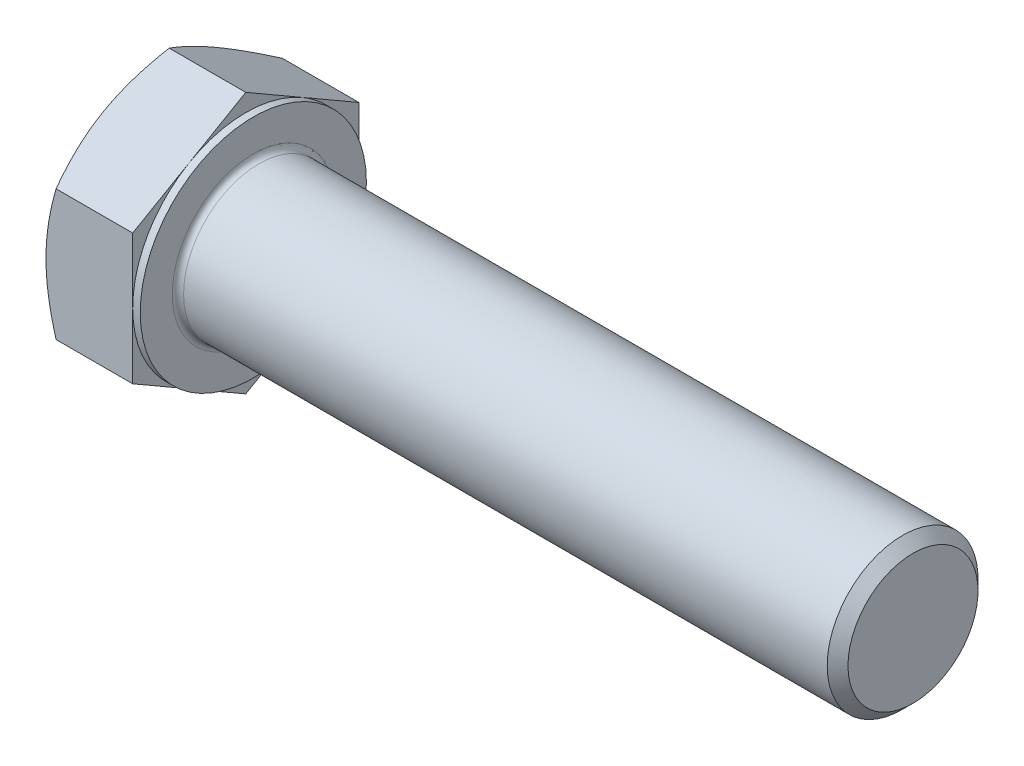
ISO-10303-21;
HEADER;
FILE_DESCRIPTION(('STEP AP214'),'2;1');
FILE_NAME('part.step','',(''),(''),'','','');
FILE_SCHEMA(('AUTOMOTIVE_DESIGN { 1 0 10303 214 1 1 1 1 }'));
ENDSEC;
DATA;
#1=APPLICATION_CONTEXT('core data for automotive mechanical design processes');
#2=APPLICATION_PROTOCOL_DEFINITION('international standard','automotive_design',2000,#1);
#3=PRODUCT_CONTEXT('',#1,'mechanical');
#4=PRODUCT('Part','Part','',(#3));
#5=PRODUCT_RELATED_PRODUCT_CATEGORY('part','',(#4));
#6=PRODUCT_DEFINITION_FORMATION('','',#4);
#7=PRODUCT_DEFINITION_CONTEXT('part definition',#1,'design');
#8=PRODUCT_DEFINITION('design','',#6,#7);
#9=PRODUCT_DEFINITION_SHAPE('','',#8);
#10=(LENGTH_UNIT() NAMED_UNIT(*) SI_UNIT(.MILLI.,.METRE.));
#11=(NAMED_UNIT(*) PLANE_ANGLE_UNIT() SI_UNIT($,.RADIAN.));
#12=(NAMED_UNIT(*) SI_UNIT($,.STERADIAN.) SOLID_ANGLE_UNIT());
#13=UNCERTAINTY_MEASURE_WITH_UNIT(LENGTH_MEASURE(1.E-05),#10,'distance_accuracy_value','');
#14=(GEOMETRIC_REPRESENTATION_CONTEXT(3) GLOBAL_UNCERTAINTY_ASSIGNED_CONTEXT((#13)) GLOBAL_UNIT_ASSIGNED_CONTEXT((#10,
#11,#12)) REPRESENTATION_CONTEXT('',''));
#15=CARTESIAN_POINT('',(0.,0.,0.));
#16=DIRECTION('',(0.,0.,1.));
#17=DIRECTION('',(1.,0.,0.));
#18=AXIS2_PLACEMENT_3D('',#15,#16,#17);
#19=CARTESIAN_POINT('',(10.,13.856406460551,0.));
#20=DIRECTION('',(1.,0.,0.));
#21=DIRECTION('',(0.,0.,-1.));
#22=AXIS2_PLACEMENT_3D('',#19,#20,#21);
#23=PLANE('',#22);
#24=CARTESIAN_POINT('',(10.,0.,0.));
#25=DIRECTION('',(1.,0.,0.));
#26=DIRECTION('',(0.,0.,-1.));
#27=AXIS2_PLACEMENT_3D('',#24,#25,#26);
#28=CIRCLE('',#27,8.6);
#29=CARTESIAN_POINT('',(10.,0.,-8.6));
#30=VERTEX_POINT('',#29);
#31=EDGE_CURVE('E43',#30,#30,#28,.F.);
#32=ORIENTED_EDGE('',*,*,#31,.T.);
#33=EDGE_LOOP('',(#32));
#34=FACE_BOUND('',#33,.T.);
#35=CARTESIAN_POINT('',(10.,0.,0.));
#36=DIRECTION('',(1.,0.,0.));
#37=DIRECTION('',(0.,0.,-1.));
#38=AXIS2_PLACEMENT_3D('',#35,#36,#37);
#39=CIRCLE('',#38,12.);
#40=CARTESIAN_POINT('',(10.,0.,-12.));
#41=VERTEX_POINT('',#40);
#42=EDGE_CURVE('E300',#41,#41,#39,.T.);
#43=ORIENTED_EDGE('',*,*,#42,.T.);
#44=EDGE_LOOP('',(#43));
#45=FACE_BOUND('',#44,.T.);
#46=ADVANCED_FACE('F35',(#34,#45),#23,.T.);
#47=CARTESIAN_POINT('',(0.,0.,0.));
#48=DIRECTION('',(-1.,0.,0.));
#49=DIRECTION('',(0.,0.,1.));
#50=AXIS2_PLACEMENT_3D('',#47,#48,#49);
#51=CYLINDRICAL_SURFACE('',#50,8.);
#52=CARTESIAN_POINT('',(10.6,0.,0.));
#53=DIRECTION('',(1.,0.,0.));
#54=DIRECTION('',(0.,0.,-1.));
#55=AXIS2_PLACEMENT_3D('',#52,#53,#54);
#56=CIRCLE('',#55,8.);
#57=CARTESIAN_POINT('',(10.6,0.,-8.));
#58=VERTEX_POINT('',#57);
#59=EDGE_CURVE('E11',#58,#58,#56,.T.);
#60=ORIENTED_EDGE('',*,*,#59,.T.);
#61=EDGE_LOOP('',(#60));
#62=FACE_BOUND('',#61,.T.);
#63=CARTESIAN_POINT('',(78.8985,0.,0.));
#64=DIRECTION('',(-1.,0.,0.));
#65=DIRECTION('',(0.,0.,1.));
#66=AXIS2_PLACEMENT_3D('',#63,#64,#65);
#67=CIRCLE('',#66,8.);
#68=CARTESIAN_POINT('',(78.8985,0.,8.));
#69=VERTEX_POINT('',#68);
#70=EDGE_CURVE('E279',#69,#69,#67,.T.);
#71=ORIENTED_EDGE('',*,*,#70,.T.);
#72=EDGE_LOOP('',(#71));
#73=FACE_BOUND('',#72,.T.);
#74=ADVANCED_FACE('F253',(#62,#73),#51,.T.);
#75=CARTESIAN_POINT('',(80.,0.,0.));
#76=DIRECTION('',(-1.,0.,0.));
#77=DIRECTION('',(0.,0.,1.));
#78=AXIS2_PLACEMENT_3D('',#75,#76,#77);
#79=CONICAL_SURFACE('',#78,6.8985,0.785398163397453);
#80=ORIENTED_EDGE('',*,*,#70,.F.);
#81=EDGE_LOOP('',(#80));
#82=FACE_BOUND('',#81,.T.);
#83=CARTESIAN_POINT('',(80.,0.,0.));
#84=DIRECTION('',(-1.,0.,0.));
#85=DIRECTION('',(0.,0.,1.));
#86=AXIS2_PLACEMENT_3D('',#83,#84,#85);
#87=CIRCLE('',#86,6.8985);
#88=CARTESIAN_POINT('',(80.,0.,6.8985));
#89=VERTEX_POINT('',#88);
#90=EDGE_CURVE('E277',#89,#89,#87,.T.);
#91=ORIENTED_EDGE('',*,*,#90,.T.);
#92=EDGE_LOOP('',(#91));
#93=FACE_BOUND('',#92,.T.);
#94=ADVANCED_FACE('F258',(#82,#93),#79,.T.);
#95=CARTESIAN_POINT('',(80.,0.,0.));
#96=DIRECTION('',(-1.,0.,0.));
#97=DIRECTION('',(0.,0.,1.));
#98=AXIS2_PLACEMENT_3D('',#95,#96,#97);
#99=PLANE('',#98);
#100=ORIENTED_EDGE('',*,*,#90,.F.);
#101=EDGE_LOOP('',(#100));
#102=FACE_BOUND('',#101,.T.);
#103=ADVANCED_FACE('F265',(#102),#99,.F.);
#104=CARTESIAN_POINT('',(9.2,12.,0.));
#105=DIRECTION('',(1.,0.,0.));
#106=DIRECTION('',(0.,0.,-1.));
#107=AXIS2_PLACEMENT_3D('',#104,#105,#106);
#108=PLANE('',#107);
#109=DIRECTION('',(0.,0.500000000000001,0.866025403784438));
#110=VECTOR('',#109,1.);
#111=CARTESIAN_POINT('',(9.2,6.9282032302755,-12.));
#112=LINE('',#111,#110);
#113=CARTESIAN_POINT('',(9.2,6.9282032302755,-12.));
#114=VERTEX_POINT('',#113);
#115=CARTESIAN_POINT('',(9.2,10.3923048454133,-6.00000000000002));
#116=VERTEX_POINT('',#115);
#117=EDGE_CURVE('E167',#114,#116,#112,.T.);
#118=ORIENTED_EDGE('',*,*,#117,.T.);
#119=CARTESIAN_POINT('',(9.2,0.,0.));
#120=DIRECTION('',(-1.,0.,0.));
#121=DIRECTION('',(0.,0.,1.));
#122=AXIS2_PLACEMENT_3D('',#119,#120,#121);
#123=CIRCLE('',#122,12.);
#124=CARTESIAN_POINT('',(9.2,0.,-12.));
#125=VERTEX_POINT('',#124);
#126=EDGE_CURVE('E50',#116,#125,#123,.T.);
#127=ORIENTED_EDGE('',*,*,#126,.T.);
#128=DIRECTION('',(0.,1.,0.));
#129=VECTOR('',#128,1.);
#130=CARTESIAN_POINT('',(9.2,6.9282032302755,-12.));
#131=LINE('',#130,#129);
#132=EDGE_CURVE('E303',#125,#114,#131,.T.);
#133=ORIENTED_EDGE('',*,*,#132,.T.);
#134=EDGE_LOOP('',(#118,#127,#133));
#135=FACE_BOUND('',#134,.T.);
#136=ADVANCED_FACE('F268',(#135),#108,.T.);
#137=CARTESIAN_POINT('',(9.2,13.856406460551,0.));
#138=VERTEX_POINT('',#137);
#139=EDGE_CURVE('E165',#116,#138,#112,.T.);
#140=ORIENTED_EDGE('',*,*,#139,.T.);
#141=DIRECTION('',(0.,-0.500000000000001,0.866025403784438));
#142=VECTOR('',#141,1.);
#143=CARTESIAN_POINT('',(9.2,13.856406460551,0.));
#144=LINE('',#143,#142);
#145=CARTESIAN_POINT('',(9.2,10.3923048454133,6.00000000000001));
#146=VERTEX_POINT('',#145);
#147=EDGE_CURVE('E164',#138,#146,#144,.T.);
#148=ORIENTED_EDGE('',*,*,#147,.T.);
#149=EDGE_CURVE('E153',#146,#116,#123,.T.);
#150=ORIENTED_EDGE('',*,*,#149,.T.);
#151=EDGE_LOOP('',(#140,#148,#150));
#152=FACE_BOUND('',#151,.T.);
#153=ADVANCED_FACE('F273',(#152),#108,.T.);
#154=CARTESIAN_POINT('',(9.2,6.9282032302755,12.));
#155=VERTEX_POINT('',#154);
#156=EDGE_CURVE('E132',#146,#155,#144,.T.);
#157=ORIENTED_EDGE('',*,*,#156,.T.);
#158=DIRECTION('',(0.,-1.,0.));
#159=VECTOR('',#158,1.);
#160=CARTESIAN_POINT('',(9.2,6.9282032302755,12.));
#161=LINE('',#160,#159);
#162=CARTESIAN_POINT('',(9.2,0.,12.));
#163=VERTEX_POINT('',#162);
#164=EDGE_CURVE('E126',#155,#163,#161,.T.);
#165=ORIENTED_EDGE('',*,*,#164,.T.);
#166=EDGE_CURVE('E130',#163,#146,#123,.T.);
#167=ORIENTED_EDGE('',*,*,#166,.T.);
#168=EDGE_LOOP('',(#157,#165,#167));
#169=FACE_BOUND('',#168,.T.);
#170=ADVANCED_FACE('F128',(#169),#108,.T.);
#171=CARTESIAN_POINT('',(9.2,-6.92820323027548,12.));
#172=VERTEX_POINT('',#171);
#173=EDGE_CURVE('E136',#163,#172,#161,.T.);
#174=ORIENTED_EDGE('',*,*,#173,.T.);
#175=DIRECTION('',(0.,-0.500000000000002,-0.866025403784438));
#176=VECTOR('',#175,1.);
#177=CARTESIAN_POINT('',(9.2,-13.856406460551,0.));
#178=LINE('',#177,#176);
#179=CARTESIAN_POINT('',(9.2,-10.3923048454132,6.00000000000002));
#180=VERTEX_POINT('',#179);
#181=EDGE_CURVE('E143',#172,#180,#178,.T.);
#182=ORIENTED_EDGE('',*,*,#181,.T.);
#183=EDGE_CURVE('E140',#180,#163,#123,.T.);
#184=ORIENTED_EDGE('',*,*,#183,.T.);
#185=EDGE_LOOP('',(#174,#182,#184));
#186=FACE_BOUND('',#185,.T.);
#187=ADVANCED_FACE('F141',(#186),#108,.T.);
#188=CARTESIAN_POINT('',(9.2,-13.856406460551,0.));
#189=VERTEX_POINT('',#188);
#190=EDGE_CURVE('E159',#180,#189,#178,.T.);
#191=ORIENTED_EDGE('',*,*,#190,.T.);
#192=DIRECTION('',(0.,0.5,-0.866025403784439));
#193=VECTOR('',#192,1.);
#194=CARTESIAN_POINT('',(9.2,-6.92820323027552,-12.));
#195=LINE('',#194,#193);
#196=CARTESIAN_POINT('',(9.2,-10.3923048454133,-6.));
#197=VERTEX_POINT('',#196);
#198=EDGE_CURVE('E341',#189,#197,#195,.T.);
#199=ORIENTED_EDGE('',*,*,#198,.T.);
#200=EDGE_CURVE('E147',#197,#180,#123,.T.);
#201=ORIENTED_EDGE('',*,*,#200,.T.);
#202=EDGE_LOOP('',(#191,#199,#201));
#203=FACE_BOUND('',#202,.T.);
#204=ADVANCED_FACE('F342',(#203),#108,.T.);
#205=CARTESIAN_POINT('',(9.2,-6.92820323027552,-12.));
#206=VERTEX_POINT('',#205);
#207=EDGE_CURVE('E154',#197,#206,#195,.T.);
#208=ORIENTED_EDGE('',*,*,#207,.T.);
#209=EDGE_CURVE('E304',#206,#125,#131,.T.);
#210=ORIENTED_EDGE('',*,*,#209,.T.);
#211=EDGE_CURVE('E311',#125,#197,#123,.T.);
#212=ORIENTED_EDGE('',*,*,#211,.T.);
#213=EDGE_LOOP('',(#208,#210,#212));
#214=FACE_BOUND('',#213,.T.);
#215=ADVANCED_FACE('F274',(#214),#108,.T.);
#216=CARTESIAN_POINT('',(0.,0.,0.));
#217=DIRECTION('',(-1.,0.,0.));
#218=DIRECTION('',(0.,0.,1.));
#219=AXIS2_PLACEMENT_3D('',#216,#217,#218);
#220=CYLINDRICAL_SURFACE('',#219,12.);
#221=ORIENTED_EDGE('',*,*,#126,.F.);
#222=ORIENTED_EDGE('',*,*,#149,.F.);
#223=ORIENTED_EDGE('',*,*,#166,.F.);
#224=ORIENTED_EDGE('',*,*,#183,.F.);
#225=ORIENTED_EDGE('',*,*,#200,.F.);
#226=ORIENTED_EDGE('',*,*,#211,.F.);
#227=EDGE_LOOP('',(#221,#222,#223,#224,#225,#226));
#228=FACE_BOUND('',#227,.T.);
#229=ORIENTED_EDGE('',*,*,#42,.F.);
#230=EDGE_LOOP('',(#229));
#231=FACE_BOUND('',#230,.T.);
#232=ADVANCED_FACE('F150',(#228,#231),#220,.T.);
#233=CARTESIAN_POINT('',(0.,13.856406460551,0.));
#234=DIRECTION('',(1.,0.,0.));
#235=DIRECTION('',(0.,0.,-1.));
#236=AXIS2_PLACEMENT_3D('',#233,#234,#235);
#237=PLANE('',#236);
#238=CARTESIAN_POINT('',(0.,0.,0.));
#239=DIRECTION('',(1.,0.,0.));
#240=DIRECTION('',(0.,0.,-1.));
#241=AXIS2_PLACEMENT_3D('',#238,#239,#240);
#242=CIRCLE('',#241,12.);
#243=CARTESIAN_POINT('',(0.,0.,-12.));
#244=VERTEX_POINT('',#243);
#245=CARTESIAN_POINT('',(0.,10.3923048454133,-6.00000000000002));
#246=VERTEX_POINT('',#245);
#247=EDGE_CURVE('E299',#244,#246,#242,.T.);
#248=ORIENTED_EDGE('',*,*,#247,.F.);
#249=CARTESIAN_POINT('',(0.,-10.3923048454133,-6.));
#250=VERTEX_POINT('',#249);
#251=EDGE_CURVE('E295',#250,#244,#242,.T.);
#252=ORIENTED_EDGE('',*,*,#251,.F.);
#253=CARTESIAN_POINT('',(0.,-10.3923048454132,6.00000000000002));
#254=VERTEX_POINT('',#253);
#255=EDGE_CURVE('E298',#254,#250,#242,.T.);
#256=ORIENTED_EDGE('',*,*,#255,.F.);
#257=CARTESIAN_POINT('',(0.,0.,12.));
#258=VERTEX_POINT('',#257);
#259=EDGE_CURVE('E334',#258,#254,#242,.T.);
#260=ORIENTED_EDGE('',*,*,#259,.F.);
#261=CARTESIAN_POINT('',(0.,0.,0.));
#262=DIRECTION('',(-1.,0.,0.));
#263=DIRECTION('',(0.,0.,1.));
#264=AXIS2_PLACEMENT_3D('',#261,#262,#263);
#265=CIRCLE('',#264,12.);
#266=CARTESIAN_POINT('',(0.,10.3923048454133,6.00000000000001));
#267=VERTEX_POINT('',#266);
#268=EDGE_CURVE('E168',#258,#267,#265,.T.);
#269=ORIENTED_EDGE('',*,*,#268,.T.);
#270=EDGE_CURVE('E357',#246,#267,#242,.T.);
#271=ORIENTED_EDGE('',*,*,#270,.F.);
#272=EDGE_LOOP('',(#248,#252,#256,#260,#269,#271));
#273=FACE_BOUND('',#272,.T.);
#274=ADVANCED_FACE('F199',(#273),#237,.F.);
#275=CARTESIAN_POINT('',(0.,0.,0.));
#276=DIRECTION('',(1.,0.,0.));
#277=DIRECTION('',(0.,0.,-1.));
#278=AXIS2_PLACEMENT_3D('',#275,#276,#277);
#279=CONICAL_SURFACE('',#278,12.,1.0471975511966);
#280=CARTESIAN_POINT('',(1.07186343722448,6.92808776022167,12.0002));
#281=CARTESIAN_POINT('',(0.983949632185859,7.08038456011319,11.7364142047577));
#282=CARTESIAN_POINT('',(0.900025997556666,7.2332492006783,11.4716448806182));
#283=CARTESIAN_POINT('',(0.74126621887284,7.54020434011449,10.9399829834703));
#284=CARTESIAN_POINT('',(0.666433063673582,7.69429522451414,10.6730897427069));
#285=CARTESIAN_POINT('',(0.457017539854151,8.15905073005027,9.86810959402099));
#286=CARTESIAN_POINT('',(0.337903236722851,8.47155003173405,9.3268449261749));
#287=CARTESIAN_POINT('',(0.198231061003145,8.93919090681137,8.516867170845));
#288=CARTESIAN_POINT('',(0.158443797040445,9.09293539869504,8.25057389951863));
#289=CARTESIAN_POINT('',(0.0917233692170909,9.40113622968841,7.71675440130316));
#290=CARTESIAN_POINT('',(0.064790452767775,9.55559258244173,7.44922815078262));
#291=CARTESIAN_POINT('',(0.0244685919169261,9.86476279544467,6.91372963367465));
#292=CARTESIAN_POINT('',(0.0110635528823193,10.0194761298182,6.64575827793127));
#293=CARTESIAN_POINT('',(-0.00191690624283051,10.3290461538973,6.10956726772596));
#294=CARTESIAN_POINT('',(-0.00149275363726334,10.4839028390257,5.84134762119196));
#295=CARTESIAN_POINT('',(0.0122200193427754,10.7734076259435,5.3399106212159));
#296=CARTESIAN_POINT('',(0.0238359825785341,10.908076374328,5.10665750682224));
#297=CARTESIAN_POINT('',(0.0573080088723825,11.1771041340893,4.64068775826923));
#298=CARTESIAN_POINT('',(0.0791647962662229,11.3114631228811,4.40797116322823));
#299=CARTESIAN_POINT('',(0.132737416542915,11.5797983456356,3.94320092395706));
#300=CARTESIAN_POINT('',(0.164461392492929,11.7137741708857,3.711147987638));
#301=CARTESIAN_POINT('',(0.237211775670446,11.9810977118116,3.24813003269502));
#302=CARTESIAN_POINT('',(0.278238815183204,12.1144453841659,3.01716508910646));
#303=CARTESIAN_POINT('',(0.416311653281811,12.5192297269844,2.31605804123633));
#304=CARTESIAN_POINT('',(0.527124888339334,12.789494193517,1.84794625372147));
#305=CARTESIAN_POINT('',(0.778625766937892,13.3259930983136,0.918702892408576));
#306=CARTESIAN_POINT('',(0.919254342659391,13.5922344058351,0.457559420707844));
#307=CARTESIAN_POINT('',(1.07186343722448,13.8565219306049,-0.000200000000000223));
#308=B_SPLINE_CURVE_WITH_KNOTS('',3,(#280,#281,#282,#283,#284,#285,#286,#287,#288,#289,#290,
#291,#292,#293,#294,#295,#296,#297,#298,#299,#300,#301,#302,#303,#304,#305,#306,#307),
.UNSPECIFIED.,.F.,.F.,(4,2,2,2,2,2,2,2,2,2,2,2,2,4),(0.,0.951004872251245,1.90232158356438,
3.80900466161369,4.7389455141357,5.66890426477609,6.59775529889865,7.5265776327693,
8.33514643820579,9.14377244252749,9.95306755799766,10.7624176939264,12.4167102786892,
14.0677556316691),.UNSPECIFIED.);
#309=CARTESIAN_POINT('',(1.07179676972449,13.856406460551,0.));
#310=VERTEX_POINT('',#309);
#311=EDGE_CURVE('E219',#267,#310,#308,.T.);
#312=ORIENTED_EDGE('',*,*,#311,.T.);
#313=CARTESIAN_POINT('',(1.07186343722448,13.8565219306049,0.000199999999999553));
#314=CARTESIAN_POINT('',(0.983949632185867,13.7042251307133,-0.263585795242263));
#315=CARTESIAN_POINT('',(0.900025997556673,13.5513604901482,-0.5283551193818));
#316=CARTESIAN_POINT('',(0.741266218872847,13.244405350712,-1.06001701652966));
#317=CARTESIAN_POINT('',(0.666433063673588,13.0903144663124,-1.32691025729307));
#318=CARTESIAN_POINT('',(0.457017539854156,12.6255589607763,-2.13189040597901));
#319=CARTESIAN_POINT('',(0.337903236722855,12.3130596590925,-2.6731550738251));
#320=CARTESIAN_POINT('',(0.198231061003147,11.8454187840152,-3.483132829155));
#321=CARTESIAN_POINT('',(0.158443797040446,11.6916742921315,-3.74942610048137));
#322=CARTESIAN_POINT('',(0.0917233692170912,11.3834734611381,-4.28324559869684));
#323=CARTESIAN_POINT('',(0.0647904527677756,11.2290171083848,-4.55077184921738));
#324=CARTESIAN_POINT('',(0.0244685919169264,10.9198468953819,-5.08627036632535));
#325=CARTESIAN_POINT('',(0.011063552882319,10.7651335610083,-5.35424172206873));
#326=CARTESIAN_POINT('',(-0.00191690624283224,10.4555635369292,-5.89043273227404));
#327=CARTESIAN_POINT('',(-0.00149275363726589,10.3007068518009,-6.15865237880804));
#328=CARTESIAN_POINT('',(0.0122200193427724,10.011202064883,-6.66008937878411));
#329=CARTESIAN_POINT('',(0.0238359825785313,9.87653331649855,-6.89334249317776));
#330=CARTESIAN_POINT('',(0.0573080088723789,9.60750555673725,-7.35931224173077));
#331=CARTESIAN_POINT('',(0.0791647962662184,9.47314656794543,-7.59202883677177));
#332=CARTESIAN_POINT('',(0.13273741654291,9.20481134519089,-8.05679907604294));
#333=CARTESIAN_POINT('',(0.164461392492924,9.07083551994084,-8.288852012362));
#334=CARTESIAN_POINT('',(0.237211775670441,8.80351197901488,-8.75186996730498));
#335=CARTESIAN_POINT('',(0.278238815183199,8.67016430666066,-8.98283491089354));
#336=CARTESIAN_POINT('',(0.416311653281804,8.2653799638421,-9.68394195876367));
#337=CARTESIAN_POINT('',(0.527124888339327,7.99511549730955,-10.1520537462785));
#338=CARTESIAN_POINT('',(0.778625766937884,7.45861659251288,-11.0812971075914));
#339=CARTESIAN_POINT('',(0.919254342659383,7.19237528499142,-11.5424405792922));
#340=CARTESIAN_POINT('',(1.07186343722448,6.92808776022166,-12.0002));
#341=B_SPLINE_CURVE_WITH_KNOTS('',3,(#313,#314,#315,#316,#317,#318,#319,#320,#321,#322,#323,
#324,#325,#326,#327,#328,#329,#330,#331,#332,#333,#334,#335,#336,#337,#338,#339,#340),
.UNSPECIFIED.,.F.,.F.,(4,2,2,2,2,2,2,2,2,2,2,2,2,4),(0.,0.951004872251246,1.90232158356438,
3.80900466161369,4.73894551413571,5.6689042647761,6.59775529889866,7.52657763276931,
8.33514643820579,9.1437724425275,9.95306755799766,10.7624176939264,12.4167102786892,
14.0677556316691),.UNSPECIFIED.);
#342=EDGE_CURVE('E58',#310,#246,#341,.T.);
#343=ORIENTED_EDGE('',*,*,#342,.T.);
#344=ORIENTED_EDGE('',*,*,#270,.T.);
#345=EDGE_LOOP('',(#312,#343,#344));
#346=FACE_BOUND('',#345,.T.);
#347=ADVANCED_FACE('F358',(#346),#279,.T.);
#348=CARTESIAN_POINT('',(5.93796522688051,-18.7780422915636,12.));
#349=CARTESIAN_POINT('',(5.8101358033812,-18.5152821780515,12.));
#350=CARTESIAN_POINT('',(5.68293120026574,-18.2522182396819,12.));
#351=CARTESIAN_POINT('',(5.42991281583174,-17.7254193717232,12.));
#352=CARTESIAN_POINT('',(5.3040990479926,-17.4616844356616,12.));
#353=CARTESIAN_POINT('',(4.92892368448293,-16.669310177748,12.));
#354=CARTESIAN_POINT('',(4.68186469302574,-16.1395765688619,12.));
#355=CARTESIAN_POINT('',(4.19405480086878,-15.0738169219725,12.));
#356=CARTESIAN_POINT('',(3.95334413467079,-14.5377724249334,12.));
#357=CARTESIAN_POINT('',(3.4815471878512,-13.4614790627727,12.));
#358=CARTESIAN_POINT('',(3.25046046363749,-12.9212303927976,12.));
#359=CARTESIAN_POINT('',(2.79294900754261,-11.8175688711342,12.));
#360=CARTESIAN_POINT('',(2.56693655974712,-11.2539842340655,12.));
#361=CARTESIAN_POINT('',(2.13161283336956,-10.1202797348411,12.));
#362=CARTESIAN_POINT('',(1.92230340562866,-9.55015915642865,12.));
#363=CARTESIAN_POINT('',(1.52576124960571,-8.40350794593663,12.));
#364=CARTESIAN_POINT('',(1.33848523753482,-7.82699240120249,12.));
#365=CARTESIAN_POINT('',(0.991896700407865,-6.66563869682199,12.));
#366=CARTESIAN_POINT('',(0.832575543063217,-6.08080316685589,12.));
#367=CARTESIAN_POINT('',(0.620681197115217,-5.19882791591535,12.));
#368=CARTESIAN_POINT('',(0.554713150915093,-4.90488790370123,12.));
#369=CARTESIAN_POINT('',(0.432574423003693,-4.31496880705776,12.));
#370=CARTESIAN_POINT('',(0.376403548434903,-4.01898976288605,12.));
#371=CARTESIAN_POINT('',(0.274840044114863,-3.4251844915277,12.));
#372=CARTESIAN_POINT('',(0.229447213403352,-3.12735829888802,12.));
#373=CARTESIAN_POINT('',(0.150338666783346,-2.53016033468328,12.));
#374=CARTESIAN_POINT('',(0.116622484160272,-2.23078862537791,12.));
#375=CARTESIAN_POINT('',(0.0619693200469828,-1.6348995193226,12.));
#376=CARTESIAN_POINT('',(0.0408679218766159,-1.33839729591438,12.));
#377=CARTESIAN_POINT('',(0.0112310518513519,-0.744766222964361,12.));
#378=CARTESIAN_POINT('',(0.00269536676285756,-0.447637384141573,12.));
#379=CARTESIAN_POINT('',(-0.00160621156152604,0.146715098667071,12.));
#380=CARTESIAN_POINT('',(0.00262788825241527,0.44393874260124,12.));
#381=CARTESIAN_POINT('',(0.0237602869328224,1.03793868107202,12.));
#382=CARTESIAN_POINT('',(0.0406591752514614,1.33471495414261,12.));
#383=CARTESIAN_POINT('',(0.0957363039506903,2.04293812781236,12.));
#384=CARTESIAN_POINT('',(0.139644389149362,2.45394931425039,12.));
#385=CARTESIAN_POINT('',(0.249393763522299,3.27301120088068,12.));
#386=CARTESIAN_POINT('',(0.315237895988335,3.68106151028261,12.));
#387=CARTESIAN_POINT('',(0.542190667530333,4.90025554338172,12.));
#388=CARTESIAN_POINT('',(0.732681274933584,5.70600726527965,12.));
#389=CARTESIAN_POINT('',(1.06415793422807,6.91101760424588,12.));
#390=CARTESIAN_POINT('',(1.18384338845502,7.31649624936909,12.));
#391=CARTESIAN_POINT('',(1.43593551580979,8.12351840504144,12.));
#392=CARTESIAN_POINT('',(1.56834227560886,8.52506188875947,12.));
#393=CARTESIAN_POINT('',(1.8437286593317,9.324334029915,12.));
#394=CARTESIAN_POINT('',(1.98670500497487,9.72206382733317,12.));
#395=CARTESIAN_POINT('',(2.28151949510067,10.5142091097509,12.));
#396=CARTESIAN_POINT('',(2.43335751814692,10.9086246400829,12.));
#397=CARTESIAN_POINT('',(2.81137815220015,11.863644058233,12.));
#398=CARTESIAN_POINT('',(3.04143185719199,12.4227131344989,12.));
#399=CARTESIAN_POINT('',(3.51333410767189,13.5358669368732,12.));
#400=CARTESIAN_POINT('',(3.75518348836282,14.0899513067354,12.));
#401=CARTESIAN_POINT('',(4.24823475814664,15.1941025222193,12.));
#402=CARTESIAN_POINT('',(4.49943904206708,15.7441682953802,12.));
#403=CARTESIAN_POINT('',(5.00924553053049,16.840834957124,12.));
#404=CARTESIAN_POINT('',(5.2678475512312,17.3874359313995,12.));
#405=CARTESIAN_POINT('',(5.79133880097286,18.4784293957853,12.));
#406=CARTESIAN_POINT('',(6.05623527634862,19.0228184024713,12.));
#407=CARTESIAN_POINT('',(6.59090796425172,20.1091945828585,12.));
#408=CARTESIAN_POINT('',(6.86068420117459,20.651181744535,12.));
#409=CARTESIAN_POINT('',(7.4042149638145,21.7330545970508,12.));
#410=CARTESIAN_POINT('',(7.67796889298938,22.2729405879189,12.));
#411=CARTESIAN_POINT('',(8.22882461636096,23.3510028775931,12.));
#412=CARTESIAN_POINT('',(8.5059264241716,23.8891791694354,12.));
#413=CARTESIAN_POINT('',(9.2922659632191,25.4066579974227,12.));
#414=CARTESIAN_POINT('',(9.80475659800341,26.3842748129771,12.));
#415=CARTESIAN_POINT('',(10.8366490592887,28.3358962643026,12.));
#416=CARTESIAN_POINT('',(11.3560511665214,29.3099007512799,12.));
#417=CARTESIAN_POINT('',(12.3986980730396,31.2524398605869,12.));
#418=CARTESIAN_POINT('',(12.921928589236,32.2209821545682,12.));
#419=CARTESIAN_POINT('',(13.7098172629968,33.6721037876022,12.));
#420=CARTESIAN_POINT('',(13.9729461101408,34.1555146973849,12.));
#421=CARTESIAN_POINT('',(14.5001155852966,35.1218381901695,12.));
#422=CARTESIAN_POINT('',(14.7641562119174,35.6047507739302,12.));
#423=CARTESIAN_POINT('',(15.0285993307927,36.0874429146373,12.));
#424=B_SPLINE_CURVE_WITH_KNOTS('',3,(#348,#349,#350,#351,#352,#353,#354,#355,#356,#357,#358,
#359,#360,#361,#362,#363,#364,#365,#366,#367,#368,#369,#370,#371,#372,#373,#374,#375,#376,#377,
#378,#379,#380,#381,#382,#383,#384,#385,#386,#387,#388,#389,#390,#391,#392,#393,#394,#395,#396,
#397,#398,#399,#400,#401,#402,#403,#404,#405,#406,#407,#408,#409,#410,#411,#412,#413,#414,#415,
#416,#417,#418,#419,#420,#421,#422,#423),.UNSPECIFIED.,.F.,.F.,(4,2,2,2,2,2,2,2,2,2,2,2,2,2,2,2,
2,2,2,2,2,2,2,2,2,2,2,2,2,2,2,2,2,2,2,2,2,4),(0.,0.876610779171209,1.75323004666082,
3.50671945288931,5.26947518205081,7.03214957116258,8.85359042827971,10.6752328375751,
12.4932347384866,14.3106742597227,15.2142921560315,16.1178922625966,17.02147551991,
17.9250226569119,18.8165208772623,19.7080039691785,20.5994865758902,21.4910106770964,
22.7303633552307,23.9698767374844,26.4502079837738,27.7184187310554,28.9866381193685,
30.2544657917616,31.5222760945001,33.3357454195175,35.1493433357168,36.963408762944,
38.7774291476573,40.5936500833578,42.4098801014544,44.2258404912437,46.0418082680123,
49.353175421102,52.6646774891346,55.9671781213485,57.6183303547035,59.2694800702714),.UNSPECIFIED.);
#425=CARTESIAN_POINT('',(1.07179676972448,6.92820323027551,12.));
#426=VERTEX_POINT('',#425);
#427=EDGE_CURVE('E233',#258,#426,#424,.T.);
#428=ORIENTED_EDGE('',*,*,#427,.T.);
#429=EDGE_CURVE('E232',#426,#267,#308,.T.);
#430=ORIENTED_EDGE('',*,*,#429,.T.);
#431=ORIENTED_EDGE('',*,*,#268,.F.);
#432=EDGE_LOOP('',(#428,#430,#431));
#433=FACE_BOUND('',#432,.T.);
#434=ADVANCED_FACE('F328',(#433),#279,.T.);
#435=CARTESIAN_POINT('',(1.07179676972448,-6.92820323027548,12.));
#436=VERTEX_POINT('',#435);
#437=EDGE_CURVE('E280',#436,#258,#424,.T.);
#438=ORIENTED_EDGE('',*,*,#437,.T.);
#439=ORIENTED_EDGE('',*,*,#259,.T.);
#440=CARTESIAN_POINT('',(1.07186343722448,-13.8565219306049,-0.000200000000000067));
#441=CARTESIAN_POINT('',(0.983949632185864,-13.7042251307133,0.263585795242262));
#442=CARTESIAN_POINT('',(0.900025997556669,-13.5513604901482,0.528355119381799));
#443=CARTESIAN_POINT('',(0.741266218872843,-13.244405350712,1.06001701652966));
#444=CARTESIAN_POINT('',(0.666433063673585,-13.0903144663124,1.32691025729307));
#445=CARTESIAN_POINT('',(0.457017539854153,-12.6255589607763,2.13189040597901));
#446=CARTESIAN_POINT('',(0.33790323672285,-12.3130596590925,2.6731550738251));
#447=CARTESIAN_POINT('',(0.198231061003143,-11.8454187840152,3.48313282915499));
#448=CARTESIAN_POINT('',(0.158443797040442,-11.6916742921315,3.74942610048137));
#449=CARTESIAN_POINT('',(0.0917233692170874,-11.3834734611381,4.28324559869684));
#450=CARTESIAN_POINT('',(0.0647904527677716,-11.2290171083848,4.55077184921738));
#451=CARTESIAN_POINT('',(0.0244685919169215,-10.9198468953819,5.08627036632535));
#452=CARTESIAN_POINT('',(0.0110635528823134,-10.7651335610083,5.35424172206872));
#453=CARTESIAN_POINT('',(-0.0019169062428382,-10.4555635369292,5.89043273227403));
#454=CARTESIAN_POINT('',(-0.00149275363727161,-10.3007068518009,6.15865237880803));
#455=CARTESIAN_POINT('',(0.0122200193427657,-10.011202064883,6.6600893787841));
#456=CARTESIAN_POINT('',(0.0238359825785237,-9.87653331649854,6.89334249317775));
#457=CARTESIAN_POINT('',(0.0573080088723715,-9.60750555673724,7.35931224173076));
#458=CARTESIAN_POINT('',(0.0791647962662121,-9.47314656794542,7.59202883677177));
#459=CARTESIAN_POINT('',(0.132737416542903,-9.20481134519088,8.05679907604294));
#460=CARTESIAN_POINT('',(0.164461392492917,-9.07083551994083,8.288852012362));
#461=CARTESIAN_POINT('',(0.237211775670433,-8.80351197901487,8.75186996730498));
#462=CARTESIAN_POINT('',(0.278238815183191,-8.67016430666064,8.98283491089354));
#463=CARTESIAN_POINT('',(0.416311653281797,-8.26537996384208,9.68394195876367));
#464=CARTESIAN_POINT('',(0.52712488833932,-7.99511549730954,10.1520537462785));
#465=CARTESIAN_POINT('',(0.778625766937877,-7.45861659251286,11.0812971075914));
#466=CARTESIAN_POINT('',(0.919254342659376,-7.1923752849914,11.5424405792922));
#467=CARTESIAN_POINT('',(1.07186343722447,-6.92808776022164,12.0002));
#468=B_SPLINE_CURVE_WITH_KNOTS('',3,(#440,#441,#442,#443,#444,#445,#446,#447,#448,#449,#450,
#451,#452,#453,#454,#455,#456,#457,#458,#459,#460,#461,#462,#463,#464,#465,#466,#467),
.UNSPECIFIED.,.F.,.F.,(4,2,2,2,2,2,2,2,2,2,2,2,2,4),(0.,0.951004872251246,1.90232158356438,
3.80900466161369,4.7389455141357,5.6689042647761,6.59775529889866,7.52657763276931,
8.3351464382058,9.1437724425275,9.95306755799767,10.7624176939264,12.4167102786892,
14.0677556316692),.UNSPECIFIED.);
#469=EDGE_CURVE('E221',#254,#436,#468,.T.);
#470=ORIENTED_EDGE('',*,*,#469,.T.);
#471=EDGE_LOOP('',(#438,#439,#470));
#472=FACE_BOUND('',#471,.T.);
#473=ADVANCED_FACE('F188',(#472),#279,.T.);
#474=CARTESIAN_POINT('',(1.07179676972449,-13.856406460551,0.));
#475=VERTEX_POINT('',#474);
#476=EDGE_CURVE('E213',#475,#254,#468,.T.);
#477=ORIENTED_EDGE('',*,*,#476,.T.);
#478=ORIENTED_EDGE('',*,*,#255,.T.);
#479=CARTESIAN_POINT('',(1.07186343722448,-6.92808776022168,-12.0002));
#480=CARTESIAN_POINT('',(0.983949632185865,-7.0803845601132,-11.7364142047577));
#481=CARTESIAN_POINT('',(0.900025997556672,-7.23324920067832,-11.4716448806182));
#482=CARTESIAN_POINT('',(0.741266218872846,-7.5402043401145,-10.9399829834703));
#483=CARTESIAN_POINT('',(0.666433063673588,-7.69429522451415,-10.6730897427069));
#484=CARTESIAN_POINT('',(0.457017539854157,-8.15905073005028,-9.86810959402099));
#485=CARTESIAN_POINT('',(0.337903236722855,-8.47155003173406,-9.3268449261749));
#486=CARTESIAN_POINT('',(0.198231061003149,-8.93919090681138,-8.51686717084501));
#487=CARTESIAN_POINT('',(0.158443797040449,-9.09293539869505,-8.25057389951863));
#488=CARTESIAN_POINT('',(0.0917233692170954,-9.40113622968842,-7.71675440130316));
#489=CARTESIAN_POINT('',(0.0647904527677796,-9.55559258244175,-7.44922815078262));
#490=CARTESIAN_POINT('',(0.0244685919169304,-9.86476279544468,-6.91372963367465));
#491=CARTESIAN_POINT('',(0.0110635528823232,-10.0194761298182,-6.64575827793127));
#492=CARTESIAN_POINT('',(-0.0019169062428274,-10.3290461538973,-6.10956726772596));
#493=CARTESIAN_POINT('',(-0.00149275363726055,-10.4839028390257,-5.84134762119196));
#494=CARTESIAN_POINT('',(0.012220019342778,-10.7734076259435,-5.33991062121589));
#495=CARTESIAN_POINT('',(0.0238359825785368,-10.908076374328,-5.10665750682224));
#496=CARTESIAN_POINT('',(0.0573080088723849,-11.1771041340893,-4.64068775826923));
#497=CARTESIAN_POINT('',(0.0791647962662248,-11.3114631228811,-4.40797116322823));
#498=CARTESIAN_POINT('',(0.132737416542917,-11.5797983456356,-3.94320092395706));
#499=CARTESIAN_POINT('',(0.164461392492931,-11.7137741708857,-3.711147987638));
#500=CARTESIAN_POINT('',(0.237211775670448,-11.9810977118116,-3.24813003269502));
#501=CARTESIAN_POINT('',(0.278238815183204,-12.1144453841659,-3.01716508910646));
#502=CARTESIAN_POINT('',(0.416311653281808,-12.5192297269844,-2.31605804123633));
#503=CARTESIAN_POINT('',(0.527124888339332,-12.789494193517,-1.84794625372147));
#504=CARTESIAN_POINT('',(0.778625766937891,-13.3259930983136,-0.918702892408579));
#505=CARTESIAN_POINT('',(0.91925434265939,-13.5922344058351,-0.457559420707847));
#506=CARTESIAN_POINT('',(1.07186343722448,-13.8565219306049,0.000199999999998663));
#507=B_SPLINE_CURVE_WITH_KNOTS('',3,(#479,#480,#481,#482,#483,#484,#485,#486,#487,#488,#489,
#490,#491,#492,#493,#494,#495,#496,#497,#498,#499,#500,#501,#502,#503,#504,#505,#506),
.UNSPECIFIED.,.F.,.F.,(4,2,2,2,2,2,2,2,2,2,2,2,2,4),(0.,0.951004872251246,1.90232158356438,
3.80900466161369,4.7389455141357,5.6689042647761,6.59775529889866,7.52657763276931,
8.33514643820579,9.1437724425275,9.95306755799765,10.7624176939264,12.4167102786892,
14.0677556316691),.UNSPECIFIED.);
#508=EDGE_CURVE('E220',#250,#475,#507,.T.);
#509=ORIENTED_EDGE('',*,*,#508,.T.);
#510=EDGE_LOOP('',(#477,#478,#509));
#511=FACE_BOUND('',#510,.T.);
#512=ADVANCED_FACE('F356',(#511),#279,.T.);
#513=CARTESIAN_POINT('',(1.07179676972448,6.9282032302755,-12.));
#514=VERTEX_POINT('',#513);
#515=EDGE_CURVE('E222',#246,#514,#341,.T.);
#516=ORIENTED_EDGE('',*,*,#515,.T.);
#517=CARTESIAN_POINT('',(5.93796522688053,-18.7780422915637,-12.));
#518=CARTESIAN_POINT('',(5.81013580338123,-18.5152821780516,-12.));
#519=CARTESIAN_POINT('',(5.68293120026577,-18.2522182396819,-12.));
#520=CARTESIAN_POINT('',(5.42991281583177,-17.7254193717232,-12.));
#521=CARTESIAN_POINT('',(5.30409904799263,-17.4616844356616,-12.));
#522=CARTESIAN_POINT('',(4.92892368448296,-16.6693101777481,-12.));
#523=CARTESIAN_POINT('',(4.68186469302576,-16.139576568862,-12.));
#524=CARTESIAN_POINT('',(4.1940548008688,-15.0738169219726,-12.));
#525=CARTESIAN_POINT('',(3.95334413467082,-14.5377724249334,-12.));
#526=CARTESIAN_POINT('',(3.48154718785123,-13.4614790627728,-12.));
#527=CARTESIAN_POINT('',(3.25046046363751,-12.9212303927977,-12.));
#528=CARTESIAN_POINT('',(2.79294900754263,-11.8175688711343,-12.));
#529=CARTESIAN_POINT('',(2.56693655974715,-11.2539842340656,-12.));
#530=CARTESIAN_POINT('',(2.13161283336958,-10.1202797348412,-12.));
#531=CARTESIAN_POINT('',(1.92230340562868,-9.55015915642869,-12.));
#532=CARTESIAN_POINT('',(1.52576124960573,-8.40350794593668,-12.));
#533=CARTESIAN_POINT('',(1.33848523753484,-7.82699240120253,-12.));
#534=CARTESIAN_POINT('',(0.991896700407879,-6.66563869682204,-12.));
#535=CARTESIAN_POINT('',(0.83257554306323,-6.08080316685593,-12.));
#536=CARTESIAN_POINT('',(0.620681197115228,-5.19882791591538,-12.));
#537=CARTESIAN_POINT('',(0.554713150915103,-4.90488790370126,-12.));
#538=CARTESIAN_POINT('',(0.432574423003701,-4.3149688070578,-12.));
#539=CARTESIAN_POINT('',(0.376403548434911,-4.01898976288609,-12.));
#540=CARTESIAN_POINT('',(0.274840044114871,-3.42518449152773,-12.));
#541=CARTESIAN_POINT('',(0.229447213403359,-3.12735829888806,-12.));
#542=CARTESIAN_POINT('',(0.150338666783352,-2.53016033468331,-12.));
#543=CARTESIAN_POINT('',(0.116622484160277,-2.23078862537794,-12.));
#544=CARTESIAN_POINT('',(0.0619693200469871,-1.63489951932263,-12.));
#545=CARTESIAN_POINT('',(0.04086792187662,-1.33839729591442,-12.));
#546=CARTESIAN_POINT('',(0.0112310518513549,-0.744766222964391,-12.));
#547=CARTESIAN_POINT('',(0.00269536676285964,-0.447637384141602,-12.));
#548=CARTESIAN_POINT('',(-0.00160621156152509,0.146715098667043,-12.));
#549=CARTESIAN_POINT('',(0.002627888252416,0.443938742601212,-12.));
#550=CARTESIAN_POINT('',(0.0237602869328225,1.037938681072,-12.));
#551=CARTESIAN_POINT('',(0.0406591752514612,1.33471495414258,-12.));
#552=CARTESIAN_POINT('',(0.0957363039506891,2.04293812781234,-12.));
#553=CARTESIAN_POINT('',(0.139644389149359,2.45394931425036,-12.));
#554=CARTESIAN_POINT('',(0.249393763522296,3.27301120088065,-12.));
#555=CARTESIAN_POINT('',(0.315237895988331,3.68106151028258,-12.));
#556=CARTESIAN_POINT('',(0.542190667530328,4.90025554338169,-12.));
#557=CARTESIAN_POINT('',(0.732681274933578,5.70600726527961,-12.));
#558=CARTESIAN_POINT('',(1.06415793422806,6.91101760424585,-12.));
#559=CARTESIAN_POINT('',(1.18384338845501,7.31649624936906,-12.));
#560=CARTESIAN_POINT('',(1.43593551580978,8.1235184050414,-12.));
#561=CARTESIAN_POINT('',(1.56834227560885,8.52506188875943,-12.));
#562=CARTESIAN_POINT('',(1.84372865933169,9.32433402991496,-12.));
#563=CARTESIAN_POINT('',(1.98670500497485,9.72206382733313,-12.));
#564=CARTESIAN_POINT('',(2.28151949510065,10.5142091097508,-12.));
#565=CARTESIAN_POINT('',(2.4333575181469,10.9086246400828,-12.));
#566=CARTESIAN_POINT('',(2.81137815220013,11.8636440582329,-12.));
#567=CARTESIAN_POINT('',(3.04143185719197,12.4227131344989,-12.));
#568=CARTESIAN_POINT('',(3.51333410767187,13.5358669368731,-12.));
#569=CARTESIAN_POINT('',(3.7551834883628,14.0899513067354,-12.));
#570=CARTESIAN_POINT('',(4.24823475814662,15.1941025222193,-12.));
#571=CARTESIAN_POINT('',(4.49943904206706,15.7441682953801,-12.));
#572=CARTESIAN_POINT('',(5.00924553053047,16.840834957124,-12.));
#573=CARTESIAN_POINT('',(5.26784755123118,17.3874359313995,-12.));
#574=CARTESIAN_POINT('',(5.79133880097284,18.4784293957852,-12.));
#575=CARTESIAN_POINT('',(6.0562352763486,19.0228184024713,-12.));
#576=CARTESIAN_POINT('',(6.59090796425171,20.1091945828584,-12.));
#577=CARTESIAN_POINT('',(6.86068420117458,20.651181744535,-12.));
#578=CARTESIAN_POINT('',(7.40421496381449,21.7330545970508,-12.));
#579=CARTESIAN_POINT('',(7.67796889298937,22.2729405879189,-12.));
#580=CARTESIAN_POINT('',(8.22882461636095,23.351002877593,-12.));
#581=CARTESIAN_POINT('',(8.50592642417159,23.8891791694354,-12.));
#582=CARTESIAN_POINT('',(9.29226596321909,25.4066579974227,-12.));
#583=CARTESIAN_POINT('',(9.8047565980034,26.3842748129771,-12.));
#584=CARTESIAN_POINT('',(10.8366490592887,28.3358962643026,-12.));
#585=CARTESIAN_POINT('',(11.3560511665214,29.3099007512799,-12.));
#586=CARTESIAN_POINT('',(12.3986980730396,31.2524398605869,-12.));
#587=CARTESIAN_POINT('',(12.921928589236,32.2209821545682,-12.));
#588=CARTESIAN_POINT('',(13.7098172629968,33.6721037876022,-12.));
#589=CARTESIAN_POINT('',(13.9729461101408,34.1555146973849,-12.));
#590=CARTESIAN_POINT('',(14.5001155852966,35.1218381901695,-12.));
#591=CARTESIAN_POINT('',(14.7641562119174,35.6047507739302,-12.));
#592=CARTESIAN_POINT('',(15.0285993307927,36.0874429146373,-12.));
#593=B_SPLINE_CURVE_WITH_KNOTS('',3,(#517,#518,#519,#520,#521,#522,#523,#524,#525,#526,#527,
#528,#529,#530,#531,#532,#533,#534,#535,#536,#537,#538,#539,#540,#541,#542,#543,#544,#545,#546,
#547,#548,#549,#550,#551,#552,#553,#554,#555,#556,#557,#558,#559,#560,#561,#562,#563,#564,#565,
#566,#567,#568,#569,#570,#571,#572,#573,#574,#575,#576,#577,#578,#579,#580,#581,#582,#583,#584,
#585,#586,#587,#588,#589,#590,#591,#592),.UNSPECIFIED.,.F.,.F.,(4,2,2,2,2,2,2,2,2,2,2,2,2,2,2,2,
2,2,2,2,2,2,2,2,2,2,2,2,2,2,2,2,2,2,2,2,2,4),(0.,0.876610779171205,1.75323004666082,
3.50671945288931,5.26947518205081,7.03214957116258,8.85359042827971,10.6752328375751,
12.4932347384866,14.3106742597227,15.2142921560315,16.1178922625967,17.02147551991,
17.9250226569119,18.8165208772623,19.7080039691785,20.5994865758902,21.4910106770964,
22.7303633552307,23.9698767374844,26.4502079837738,27.7184187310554,28.9866381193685,
30.2544657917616,31.5222760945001,33.3357454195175,35.1493433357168,36.963408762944,
38.7774291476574,40.5936500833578,42.4098801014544,44.2258404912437,46.0418082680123,
49.3531754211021,52.6646774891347,55.9671781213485,57.6183303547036,59.2694800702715),.UNSPECIFIED.);
#594=EDGE_CURVE('E180',#514,#244,#593,.F.);
#595=ORIENTED_EDGE('',*,*,#594,.T.);
#596=ORIENTED_EDGE('',*,*,#247,.T.);
#597=EDGE_LOOP('',(#516,#595,#596));
#598=FACE_BOUND('',#597,.T.);
#599=ADVANCED_FACE('F353',(#598),#279,.T.);
#600=CARTESIAN_POINT('',(1.07179676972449,-6.92820323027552,-12.));
#601=VERTEX_POINT('',#600);
#602=EDGE_CURVE('E181',#601,#250,#507,.T.);
#603=ORIENTED_EDGE('',*,*,#602,.T.);
#604=ORIENTED_EDGE('',*,*,#251,.T.);
#605=EDGE_CURVE('E171',#244,#601,#593,.F.);
#606=ORIENTED_EDGE('',*,*,#605,.T.);
#607=EDGE_LOOP('',(#603,#604,#606));
#608=FACE_BOUND('',#607,.T.);
#609=ADVANCED_FACE('F197',(#608),#279,.T.);
#610=CARTESIAN_POINT('',(10.,6.9282032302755,-12.));
#611=DIRECTION('',(0.,0.,1.));
#612=DIRECTION('',(0.,-1.,0.));
#613=AXIS2_PLACEMENT_3D('',#610,#611,#612);
#614=PLANE('',#613);
#615=ORIENTED_EDGE('',*,*,#209,.F.);
#616=DIRECTION('',(-1.,0.,0.));
#617=VECTOR('',#616,1.);
#618=CARTESIAN_POINT('',(10.,-6.92820323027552,-12.));
#619=LINE('',#618,#617);
#620=EDGE_CURVE('E286',#206,#601,#619,.T.);
#621=ORIENTED_EDGE('',*,*,#620,.T.);
#622=ORIENTED_EDGE('',*,*,#605,.F.);
#623=ORIENTED_EDGE('',*,*,#594,.F.);
#624=DIRECTION('',(-1.,0.,0.));
#625=VECTOR('',#624,1.);
#626=CARTESIAN_POINT('',(10.,6.9282032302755,-12.));
#627=LINE('',#626,#625);
#628=EDGE_CURVE('E282',#114,#514,#627,.T.);
#629=ORIENTED_EDGE('',*,*,#628,.F.);
#630=ORIENTED_EDGE('',*,*,#132,.F.);
#631=EDGE_LOOP('',(#615,#621,#622,#623,#629,#630));
#632=FACE_BOUND('',#631,.T.);
#633=ADVANCED_FACE('F192',(#632),#614,.F.);
#634=CARTESIAN_POINT('',(10.,-6.92820323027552,-12.));
#635=DIRECTION('',(0.,0.866025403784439,0.5));
#636=DIRECTION('',(0.,-0.5,0.866025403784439));
#637=AXIS2_PLACEMENT_3D('',#634,#635,#636);
#638=PLANE('',#637);
#639=ORIENTED_EDGE('',*,*,#198,.F.);
#640=DIRECTION('',(-1.,0.,0.));
#641=VECTOR('',#640,1.);
#642=CARTESIAN_POINT('',(10.,-13.856406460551,0.));
#643=LINE('',#642,#641);
#644=EDGE_CURVE('E288',#189,#475,#643,.T.);
#645=ORIENTED_EDGE('',*,*,#644,.T.);
#646=ORIENTED_EDGE('',*,*,#508,.F.);
#647=ORIENTED_EDGE('',*,*,#602,.F.);
#648=ORIENTED_EDGE('',*,*,#620,.F.);
#649=ORIENTED_EDGE('',*,*,#207,.F.);
#650=EDGE_LOOP('',(#639,#645,#646,#647,#648,#649));
#651=FACE_BOUND('',#650,.T.);
#652=ADVANCED_FACE('F196',(#651),#638,.F.);
#653=CARTESIAN_POINT('',(10.,-13.856406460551,0.));
#654=DIRECTION('',(0.,0.866025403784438,-0.500000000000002));
#655=DIRECTION('',(0.,0.500000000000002,0.866025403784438));
#656=AXIS2_PLACEMENT_3D('',#653,#654,#655);
#657=PLANE('',#656);
#658=ORIENTED_EDGE('',*,*,#181,.F.);
#659=DIRECTION('',(-1.,0.,0.));
#660=VECTOR('',#659,1.);
#661=CARTESIAN_POINT('',(10.,-6.92820323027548,12.));
#662=LINE('',#661,#660);
#663=EDGE_CURVE('E158',#172,#436,#662,.T.);
#664=ORIENTED_EDGE('',*,*,#663,.T.);
#665=ORIENTED_EDGE('',*,*,#469,.F.);
#666=ORIENTED_EDGE('',*,*,#476,.F.);
#667=ORIENTED_EDGE('',*,*,#644,.F.);
#668=ORIENTED_EDGE('',*,*,#190,.F.);
#669=EDGE_LOOP('',(#658,#664,#665,#666,#667,#668));
#670=FACE_BOUND('',#669,.T.);
#671=ADVANCED_FACE('F204',(#670),#657,.F.);
#672=CARTESIAN_POINT('',(10.,6.9282032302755,12.));
#673=DIRECTION('',(0.,0.,-1.));
#674=DIRECTION('',(0.,1.,0.));
#675=AXIS2_PLACEMENT_3D('',#672,#673,#674);
#676=PLANE('',#675);
#677=ORIENTED_EDGE('',*,*,#164,.F.);
#678=DIRECTION('',(-1.,0.,0.));
#679=VECTOR('',#678,1.);
#680=CARTESIAN_POINT('',(10.,6.9282032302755,12.));
#681=LINE('',#680,#679);
#682=EDGE_CURVE('E291',#155,#426,#681,.T.);
#683=ORIENTED_EDGE('',*,*,#682,.T.);
#684=ORIENTED_EDGE('',*,*,#427,.F.);
#685=ORIENTED_EDGE('',*,*,#437,.F.);
#686=ORIENTED_EDGE('',*,*,#663,.F.);
#687=ORIENTED_EDGE('',*,*,#173,.F.);
#688=EDGE_LOOP('',(#677,#683,#684,#685,#686,#687));
#689=FACE_BOUND('',#688,.T.);
#690=ADVANCED_FACE('F156',(#689),#676,.F.);
#691=CARTESIAN_POINT('',(10.,13.856406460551,0.));
#692=DIRECTION('',(0.,-0.866025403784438,-0.500000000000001));
#693=DIRECTION('',(0.,0.500000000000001,-0.866025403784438));
#694=AXIS2_PLACEMENT_3D('',#691,#692,#693);
#695=PLANE('',#694);
#696=ORIENTED_EDGE('',*,*,#147,.F.);
#697=DIRECTION('',(-1.,0.,0.));
#698=VECTOR('',#697,1.);
#699=CARTESIAN_POINT('',(10.,13.856406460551,0.));
#700=LINE('',#699,#698);
#701=EDGE_CURVE('E293',#138,#310,#700,.T.);
#702=ORIENTED_EDGE('',*,*,#701,.T.);
#703=ORIENTED_EDGE('',*,*,#311,.F.);
#704=ORIENTED_EDGE('',*,*,#429,.F.);
#705=ORIENTED_EDGE('',*,*,#682,.F.);
#706=ORIENTED_EDGE('',*,*,#156,.F.);
#707=EDGE_LOOP('',(#696,#702,#703,#704,#705,#706));
#708=FACE_BOUND('',#707,.T.);
#709=ADVANCED_FACE('F239',(#708),#695,.F.);
#710=CARTESIAN_POINT('',(10.,6.9282032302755,-12.));
#711=DIRECTION('',(0.,-0.866025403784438,0.500000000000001));
#712=DIRECTION('',(0.,-0.500000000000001,-0.866025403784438));
#713=AXIS2_PLACEMENT_3D('',#710,#711,#712);
#714=PLANE('',#713);
#715=ORIENTED_EDGE('',*,*,#117,.F.);
#716=ORIENTED_EDGE('',*,*,#628,.T.);
#717=ORIENTED_EDGE('',*,*,#515,.F.);
#718=ORIENTED_EDGE('',*,*,#342,.F.);
#719=ORIENTED_EDGE('',*,*,#701,.F.);
#720=ORIENTED_EDGE('',*,*,#139,.F.);
#721=EDGE_LOOP('',(#715,#716,#717,#718,#719,#720));
#722=FACE_BOUND('',#721,.T.);
#723=ADVANCED_FACE('F242',(#722),#714,.F.);
#724=CARTESIAN_POINT('',(10.6,0.,0.));
#725=DIRECTION('',(1.,0.,0.));
#726=DIRECTION('',(0.,0.,-1.));
#727=AXIS2_PLACEMENT_3D('',#724,#725,#726);
#728=TOROIDAL_SURFACE('',#727,8.6,0.6);
#729=ORIENTED_EDGE('',*,*,#59,.F.);
#730=EDGE_LOOP('',(#729));
#731=FACE_BOUND('',#730,.T.);
#732=ORIENTED_EDGE('',*,*,#31,.F.);
#733=EDGE_LOOP('',(#732));
#734=FACE_BOUND('',#733,.T.);
#735=ADVANCED_FACE('F37',(#731,#734),#728,.F.);
#736=CLOSED_SHELL('',(#46,#74,#94,#103,#136,#153,#170,#187,#204,#215,#232,#274,#347,#434,#473,
#512,#599,#609,#633,#652,#671,#690,#709,#723,#735));
#737=MANIFOLD_SOLID_BREP('B2',#736);
#738=ADVANCED_BREP_SHAPE_REPRESENTATION('',(#18,#737),#14);
#739=SHAPE_DEFINITION_REPRESENTATION(#9,#738);
ENDSEC;
END-ISO-10303-21;
